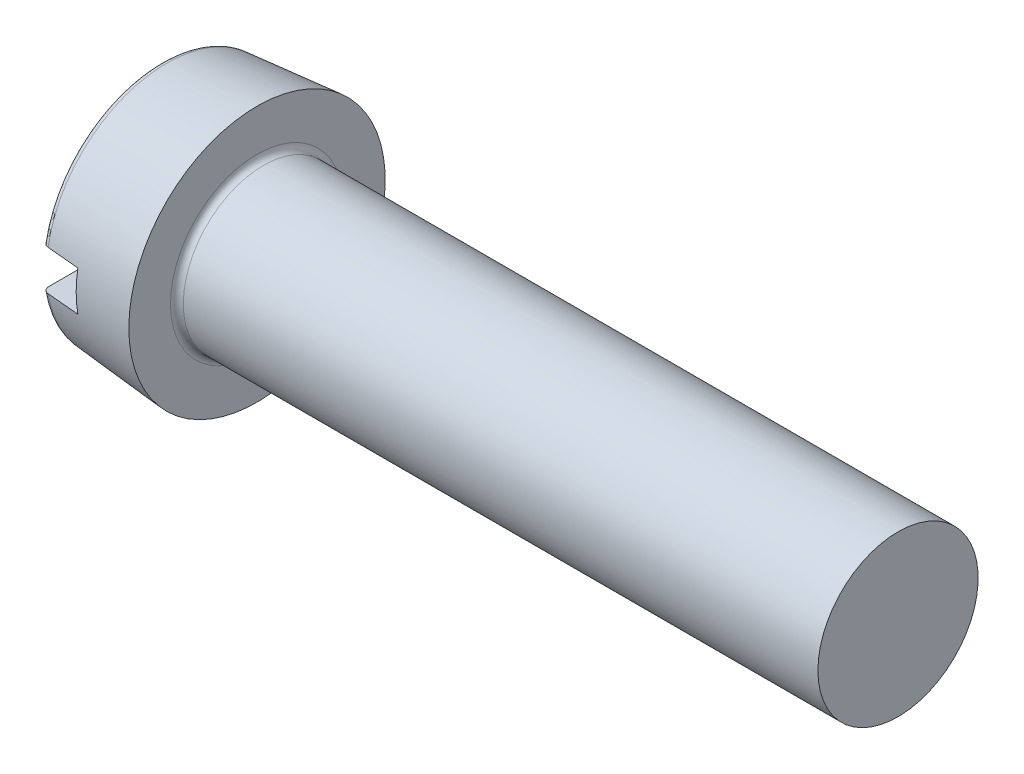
from build123d import *

# Parameters (mm, degrees)
FILLET1_R  = 0.4
FILLET2_R  = 0.4
SLOTSKE_W  = 16
SLOTSKE_H  = 2.5
SLOT_DEPTH = 2.4


with BuildPart() as part:
    # BodySke → BaseBody (revolve)
    with BuildSketch(Plane.XY, mode=Mode.PRIVATE) as basebody_sk:
        Polygon((0, 0), (0, 7.475068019), (6, 8), (6, 5), (46, 5), (46, 0), align=None)
    revolve(basebody_sk.sketch.rotate(Axis((0, 0, 0), (1, 0, 0)), 90), axis=Axis((0, 0, 0), (1, 0, 0)))

    # Fillet1
    fillet1_edges = [part.edges().sort_by_distance(p)[0] for p in [
        (6, 0, -5),
    ]]
    fillet(fillet1_edges, radius=FILLET1_R)

    # Fillet2
    fillet2_edges = [part.edges().sort_by_distance(p)[0] for p in [
        (0, 0, -7.475068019),
    ]]
    fillet(fillet2_edges, radius=FILLET2_R)

    # SlotSke → Slot (cut)
    with BuildSketch(Plane.ZY):
        Rectangle(SLOTSKE_W, SLOTSKE_H)
    extrude(amount=-SLOT_DEPTH, mode=Mode.SUBTRACT)


solid = part.part
